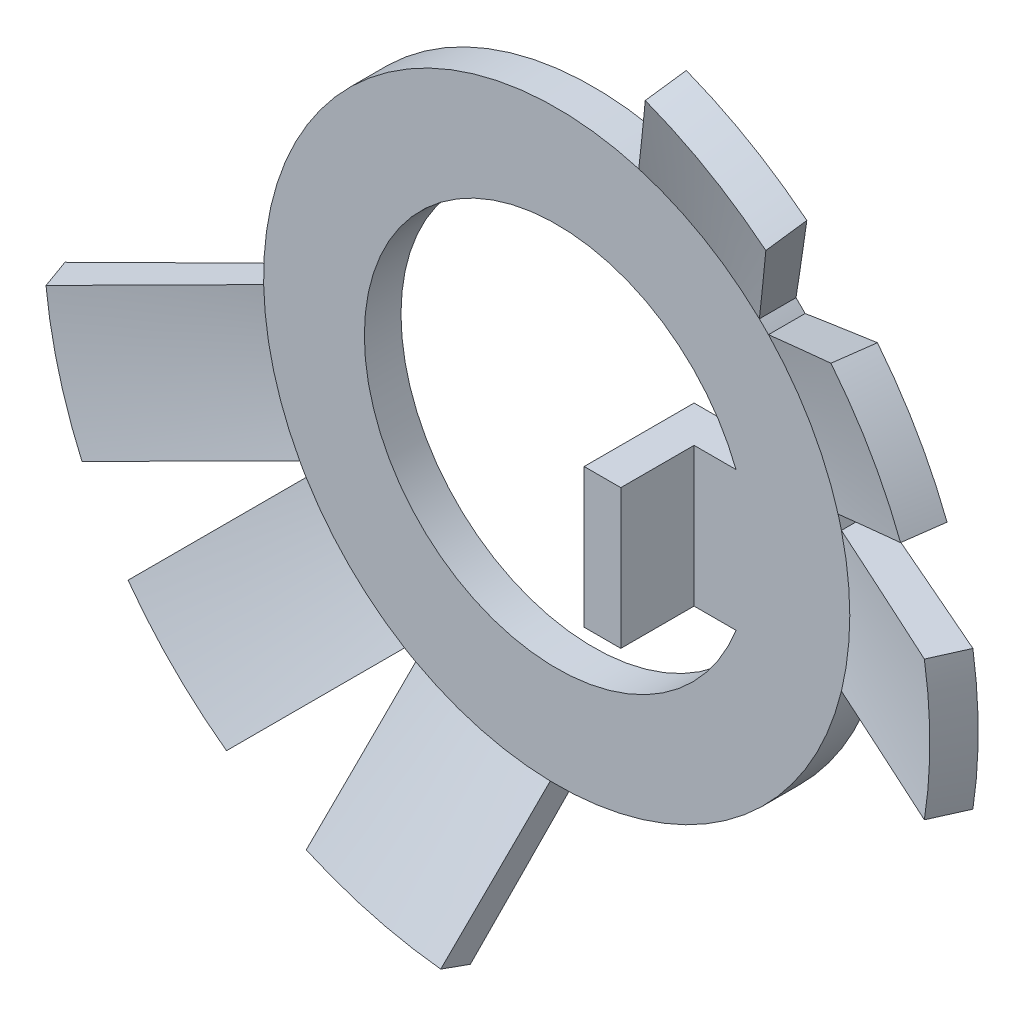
from build123d import *

# Parameters (mm, degrees)
SKETCH2_OUTSIDE_W = 34.094
SKETCH2_OUTSIDE_H = 34.094
CUT_EXTRUDE_DEPTH = 21.321185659
SKETCH4_W         = 3.8
SKETCH4_H         = 2
EXTRUDE1_DEPTH    = 1


with BuildPart() as part:
    # Sketch1 → Base-Extrude (revolve)
    with BuildSketch(Plane.YZ, mode=Mode.PRIVATE) as base_extrude_sk:
        Polygon((0, -2.909378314), (-8, -2.909378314), (-12.5, -0.91417266), (-12.094675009, 0), (-8, -1.909378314), (0, -1.909378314), align=None)
    revolve(base_extrude_sk.sketch.rotate(Axis((0, 0, 5.823648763), (0, 0, -1)), 270), axis=Axis((0, 0, 5.823648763), (0, 0, -1)))

    # Sketch2 outside → Cut-Extrude (cut, through all)
    # profile 1 of 2: a face of its own
    with BuildSketch(Plane(origin=(-2.40435344, 1.003568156, -2.909378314), x_dir=(-1, 0, 0), z_dir=(0, 0, -1))):
        with Locations((-2.404, -1.004)):
            Rectangle(SKETCH2_OUTSIDE_W, SKETCH2_OUTSIDE_H)
        with BuildLine():
            Line((-10.175453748, -2.903568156), (-14.759109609, -2.903568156))
            ThreePointArc((-14.759109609, -2.903568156), (-14.90435344, -1.003568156), (-14.759109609, 0.896431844))
            Line((-14.759109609, 0.896431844), (-10.175453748, 0.896431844))
            ThreePointArc((-10.175453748, 0.896431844), (-10.13176005, 1.066984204), (-10.084323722, 1.236533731))
            Line((-10.084323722, 1.236533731), (-14.05388614, 3.528361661))
            ThreePointArc((-14.05388614, 3.528361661), (-13.229670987, 5.246431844), (-12.15388614, 6.819258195))
            Line((-12.15388614, 6.819258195), (-8.184323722, 4.527430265))
            ThreePointArc((-8.184323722, 4.527430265), (-8.061207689, 4.653286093), (-7.935351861, 4.776402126))
            Line((-7.935351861, 4.776402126), (-10.227179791, 8.745964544))
            ThreePointArc((-10.227179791, 8.745964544), (-8.65435344, 9.821749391), (-6.936283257, 10.645964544))
            Line((-6.936283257, 10.645964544), (-4.644455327, 6.676402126))
            ThreePointArc((-4.644455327, 6.676402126), (2.465737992, 5.343258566), (5.593709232, -1.179617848))
            Line((5.593709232, -1.179617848), (10.021180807, -2.365955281))
            ThreePointArc((10.021180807, -2.365955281), (9.669719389, -4.23880622), (9.037668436, -6.036473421))
            Line((9.037668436, -6.036473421), (4.610196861, -4.850135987))
            ThreePointArc((4.610196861, -4.850135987), (4.523849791, -5.003568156), (4.43414717, -5.155062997))
            Line((4.43414717, -5.155062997), (7.675281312, -8.396197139))
            ThreePointArc((7.675281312, -8.396197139), (6.434481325, -9.842402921), (4.988275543, -11.083202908))
            Line((4.988275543, -11.083202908), (1.747141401, -7.842068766))
            ThreePointArc((1.747141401, -7.842068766), (1.59564656, -7.931771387), (1.442214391, -8.018118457))
            Line((1.442214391, -8.018118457), (2.628551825, -12.445590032))
            ThreePointArc((2.628551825, -12.445590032), (0.830884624, -13.077640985), (-1.041966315, -13.429102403))
            Line((-1.041966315, -13.429102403), (-2.228303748, -9.001630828))
            ThreePointArc((-2.228303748, -9.001630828), (-7.274444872, -7.350394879), (-10.175453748, -2.903568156))
        make_face(mode=Mode.SUBTRACT)
    # profile 2 of 2: a face of its own
    with BuildSketch(Plane(origin=(-2.40435344, 1.003568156, -2.909378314), x_dir=(-1, 0, 0), z_dir=(0, 0, -1))):
        with BuildLine():
            Line((-7.298482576, 0.896431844), (-5.15435344, 0.896431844))
            Line((-5.15435344, 0.896431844), (-5.15435344, -2.903568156))
            Line((-5.15435344, -2.903568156), (-7.298482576, -2.903568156))
            ThreePointArc((-7.298482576, -2.903568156), (2.84564656, -1.003568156), (-7.298482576, 0.896431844))
        make_face()
    extrude(amount=-CUT_EXTRUDE_DEPTH, mode=Mode.SUBTRACT)

    # Sketch4 → Extrude1 (add)
    with BuildSketch(Plane(origin=(2.75, -0.667304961, -0.255028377), x_dir=(0, 1, 0), z_dir=(-1, 0, 0))):
        with Locations((0.667304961, 0.654349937)):
            Rectangle(SKETCH4_W, SKETCH4_H)
    extrude(amount=-EXTRUDE1_DEPTH)


solid = part.part
